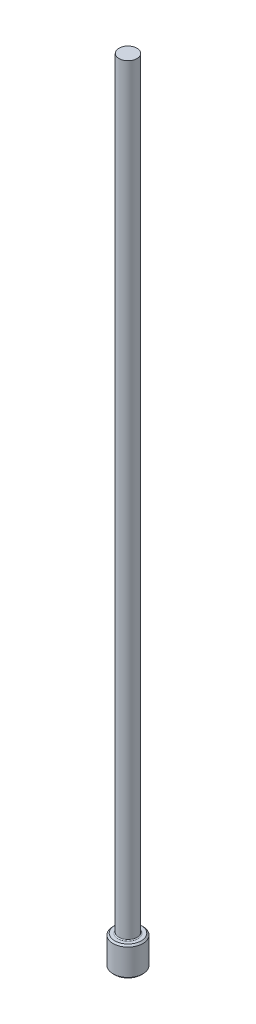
from build123d import *

# Parameters (mm, degrees)
CHAMFER1_SIZE = 0.127
FILLET1_R     = 0.0762


with BuildPart() as part:
    # Sketch1 → Revolve1 (revolve)
    with BuildSketch(Plane.XY, mode=Mode.PRIVATE) as revolve1_sk:
        Polygon((0, 0), (-1.1938, 0), (-1.1938, 2.3622), (-0.7239, 2.3622), (-0.7239, 63.5), (0, 63.5), align=None)
    revolve(revolve1_sk.sketch.rotate(Axis((0, 259.958771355, 0), (0, -1, 0)), 270), axis=Axis((0, 259.958771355, 0), (0, -1, 0)))

    # Chamfer1
    chamfer1_edges = [part.edges().sort_by_distance(p)[0] for p in [
        (0, 2.3622, -1.1938),
        (0, 0, -1.1938),
    ]]
    chamfer(chamfer1_edges, length=CHAMFER1_SIZE)

    # Fillet1
    fillet1_edges = [part.edges().sort_by_distance(p)[0] for p in [
        (0, 2.3622, -0.7239),
    ]]
    fillet(fillet1_edges, radius=FILLET1_R)


solid = part.part
